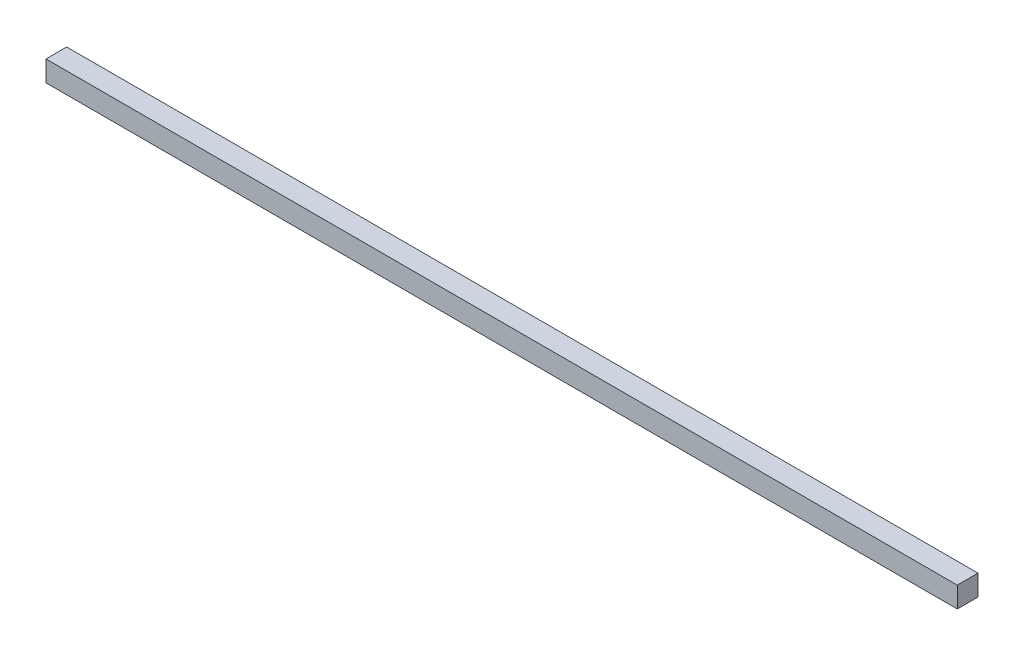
ISO-10303-21;
HEADER;
FILE_DESCRIPTION(('STEP AP214'),'2;1');
FILE_NAME('part.step','',(''),(''),'','','');
FILE_SCHEMA(('AUTOMOTIVE_DESIGN { 1 0 10303 214 1 1 1 1 }'));
ENDSEC;
DATA;
#1=APPLICATION_CONTEXT('core data for automotive mechanical design processes');
#2=APPLICATION_PROTOCOL_DEFINITION('international standard','automotive_design',2000,#1);
#3=PRODUCT_CONTEXT('',#1,'mechanical');
#4=PRODUCT('Part','Part','',(#3));
#5=PRODUCT_RELATED_PRODUCT_CATEGORY('part','',(#4));
#6=PRODUCT_DEFINITION_FORMATION('','',#4);
#7=PRODUCT_DEFINITION_CONTEXT('part definition',#1,'design');
#8=PRODUCT_DEFINITION('design','',#6,#7);
#9=PRODUCT_DEFINITION_SHAPE('','',#8);
#10=(LENGTH_UNIT() NAMED_UNIT(*) SI_UNIT(.MILLI.,.METRE.));
#11=(NAMED_UNIT(*) PLANE_ANGLE_UNIT() SI_UNIT($,.RADIAN.));
#12=(NAMED_UNIT(*) SI_UNIT($,.STERADIAN.) SOLID_ANGLE_UNIT());
#13=UNCERTAINTY_MEASURE_WITH_UNIT(LENGTH_MEASURE(1.E-05),#10,'distance_accuracy_value','');
#14=(GEOMETRIC_REPRESENTATION_CONTEXT(3) GLOBAL_UNCERTAINTY_ASSIGNED_CONTEXT((#13)) GLOBAL_UNIT_ASSIGNED_CONTEXT((#10,
#11,#12)) REPRESENTATION_CONTEXT('',''));
#15=CARTESIAN_POINT('',(0.,0.,0.));
#16=DIRECTION('',(0.,0.,1.));
#17=DIRECTION('',(1.,0.,0.));
#18=AXIS2_PLACEMENT_3D('',#15,#16,#17);
#19=CARTESIAN_POINT('',(440.,5.,5.));
#20=DIRECTION('',(0.,-1.,0.));
#21=DIRECTION('',(0.,0.,-1.));
#22=AXIS2_PLACEMENT_3D('',#19,#20,#21);
#23=PLANE('',#22);
#24=DIRECTION('',(0.,0.,1.));
#25=VECTOR('',#24,1.);
#26=CARTESIAN_POINT('',(0.,5.,5.));
#27=LINE('',#26,#25);
#28=CARTESIAN_POINT('',(0.,5.,-5.));
#29=VERTEX_POINT('',#28);
#30=CARTESIAN_POINT('',(0.,5.,5.));
#31=VERTEX_POINT('',#30);
#32=EDGE_CURVE('E120',#29,#31,#27,.T.);
#33=ORIENTED_EDGE('',*,*,#32,.T.);
#34=DIRECTION('',(-1.,0.,0.));
#35=VECTOR('',#34,1.);
#36=CARTESIAN_POINT('',(440.,5.,5.));
#37=LINE('',#36,#35);
#38=CARTESIAN_POINT('',(440.,5.,5.));
#39=VERTEX_POINT('',#38);
#40=EDGE_CURVE('E11',#39,#31,#37,.T.);
#41=ORIENTED_EDGE('',*,*,#40,.F.);
#42=DIRECTION('',(0.,0.,1.));
#43=VECTOR('',#42,1.);
#44=CARTESIAN_POINT('',(440.,5.,5.));
#45=LINE('',#44,#43);
#46=CARTESIAN_POINT('',(440.,5.,-5.));
#47=VERTEX_POINT('',#46);
#48=EDGE_CURVE('E101',#47,#39,#45,.T.);
#49=ORIENTED_EDGE('',*,*,#48,.F.);
#50=DIRECTION('',(-1.,0.,0.));
#51=VECTOR('',#50,1.);
#52=CARTESIAN_POINT('',(440.,5.,-5.));
#53=LINE('',#52,#51);
#54=EDGE_CURVE('E114',#47,#29,#53,.T.);
#55=ORIENTED_EDGE('',*,*,#54,.T.);
#56=EDGE_LOOP('',(#33,#41,#49,#55));
#57=FACE_BOUND('',#56,.T.);
#58=ADVANCED_FACE('F47',(#57),#23,.F.);
#59=CARTESIAN_POINT('',(440.,-5.,5.));
#60=DIRECTION('',(0.,0.,-1.));
#61=DIRECTION('',(-1.,0.,0.));
#62=AXIS2_PLACEMENT_3D('',#59,#60,#61);
#63=PLANE('',#62);
#64=DIRECTION('',(0.,-1.,0.));
#65=VECTOR('',#64,1.);
#66=CARTESIAN_POINT('',(0.,-5.,5.));
#67=LINE('',#66,#65);
#68=CARTESIAN_POINT('',(0.,-5.,5.));
#69=VERTEX_POINT('',#68);
#70=EDGE_CURVE('E106',#31,#69,#67,.T.);
#71=ORIENTED_EDGE('',*,*,#70,.T.);
#72=DIRECTION('',(-1.,0.,0.));
#73=VECTOR('',#72,1.);
#74=CARTESIAN_POINT('',(440.,-5.,5.));
#75=LINE('',#74,#73);
#76=CARTESIAN_POINT('',(440.,-5.,5.));
#77=VERTEX_POINT('',#76);
#78=EDGE_CURVE('E59',#77,#69,#75,.T.);
#79=ORIENTED_EDGE('',*,*,#78,.F.);
#80=DIRECTION('',(0.,-1.,0.));
#81=VECTOR('',#80,1.);
#82=CARTESIAN_POINT('',(440.,-5.,5.));
#83=LINE('',#82,#81);
#84=EDGE_CURVE('E96',#39,#77,#83,.T.);
#85=ORIENTED_EDGE('',*,*,#84,.F.);
#86=ORIENTED_EDGE('',*,*,#40,.T.);
#87=EDGE_LOOP('',(#71,#79,#85,#86));
#88=FACE_BOUND('',#87,.T.);
#89=ADVANCED_FACE('F104',(#88),#63,.F.);
#90=CARTESIAN_POINT('',(440.,-5.,5.));
#91=DIRECTION('',(0.,1.,0.));
#92=DIRECTION('',(0.,0.,1.));
#93=AXIS2_PLACEMENT_3D('',#90,#91,#92);
#94=PLANE('',#93);
#95=DIRECTION('',(0.,0.,-1.));
#96=VECTOR('',#95,1.);
#97=CARTESIAN_POINT('',(0.,-5.,5.));
#98=LINE('',#97,#96);
#99=CARTESIAN_POINT('',(0.,-5.,-5.));
#100=VERTEX_POINT('',#99);
#101=EDGE_CURVE('E83',#69,#100,#98,.T.);
#102=ORIENTED_EDGE('',*,*,#101,.T.);
#103=DIRECTION('',(-1.,0.,0.));
#104=VECTOR('',#103,1.);
#105=CARTESIAN_POINT('',(440.,-5.,-5.));
#106=LINE('',#105,#104);
#107=CARTESIAN_POINT('',(440.,-5.,-5.));
#108=VERTEX_POINT('',#107);
#109=EDGE_CURVE('E107',#108,#100,#106,.T.);
#110=ORIENTED_EDGE('',*,*,#109,.F.);
#111=DIRECTION('',(0.,0.,-1.));
#112=VECTOR('',#111,1.);
#113=CARTESIAN_POINT('',(440.,-5.,5.));
#114=LINE('',#113,#112);
#115=EDGE_CURVE('E97',#77,#108,#114,.T.);
#116=ORIENTED_EDGE('',*,*,#115,.F.);
#117=ORIENTED_EDGE('',*,*,#78,.T.);
#118=EDGE_LOOP('',(#102,#110,#116,#117));
#119=FACE_BOUND('',#118,.T.);
#120=ADVANCED_FACE('F108',(#119),#94,.F.);
#121=CARTESIAN_POINT('',(440.,-5.,-5.));
#122=DIRECTION('',(0.,0.,1.));
#123=DIRECTION('',(1.,0.,0.));
#124=AXIS2_PLACEMENT_3D('',#121,#122,#123);
#125=PLANE('',#124);
#126=DIRECTION('',(0.,1.,0.));
#127=VECTOR('',#126,1.);
#128=CARTESIAN_POINT('',(0.,-5.,-5.));
#129=LINE('',#128,#127);
#130=EDGE_CURVE('E90',#100,#29,#129,.T.);
#131=ORIENTED_EDGE('',*,*,#130,.T.);
#132=ORIENTED_EDGE('',*,*,#54,.F.);
#133=DIRECTION('',(0.,1.,0.));
#134=VECTOR('',#133,1.);
#135=CARTESIAN_POINT('',(440.,-5.,-5.));
#136=LINE('',#135,#134);
#137=EDGE_CURVE('E66',#108,#47,#136,.T.);
#138=ORIENTED_EDGE('',*,*,#137,.F.);
#139=ORIENTED_EDGE('',*,*,#109,.T.);
#140=EDGE_LOOP('',(#131,#132,#138,#139));
#141=FACE_BOUND('',#140,.T.);
#142=ADVANCED_FACE('F128',(#141),#125,.F.);
#143=CARTESIAN_POINT('',(440.,0.,0.));
#144=DIRECTION('',(1.,0.,0.));
#145=DIRECTION('',(0.,0.,-1.));
#146=AXIS2_PLACEMENT_3D('',#143,#144,#145);
#147=PLANE('',#146);
#148=ORIENTED_EDGE('',*,*,#48,.T.);
#149=ORIENTED_EDGE('',*,*,#84,.T.);
#150=ORIENTED_EDGE('',*,*,#115,.T.);
#151=ORIENTED_EDGE('',*,*,#137,.T.);
#152=EDGE_LOOP('',(#148,#149,#150,#151));
#153=FACE_BOUND('',#152,.T.);
#154=ADVANCED_FACE('F100',(#153),#147,.T.);
#155=CARTESIAN_POINT('',(0.,0.,0.));
#156=DIRECTION('',(1.,0.,0.));
#157=DIRECTION('',(0.,0.,-1.));
#158=AXIS2_PLACEMENT_3D('',#155,#156,#157);
#159=PLANE('',#158);
#160=ORIENTED_EDGE('',*,*,#32,.F.);
#161=ORIENTED_EDGE('',*,*,#130,.F.);
#162=ORIENTED_EDGE('',*,*,#101,.F.);
#163=ORIENTED_EDGE('',*,*,#70,.F.);
#164=EDGE_LOOP('',(#160,#161,#162,#163));
#165=FACE_BOUND('',#164,.T.);
#166=ADVANCED_FACE('F134',(#165),#159,.F.);
#167=CLOSED_SHELL('',(#58,#89,#120,#142,#154,#166));
#168=MANIFOLD_SOLID_BREP('B2',#167);
#169=ADVANCED_BREP_SHAPE_REPRESENTATION('',(#18,#168),#14);
#170=SHAPE_DEFINITION_REPRESENTATION(#9,#169);
ENDSEC;
END-ISO-10303-21;
